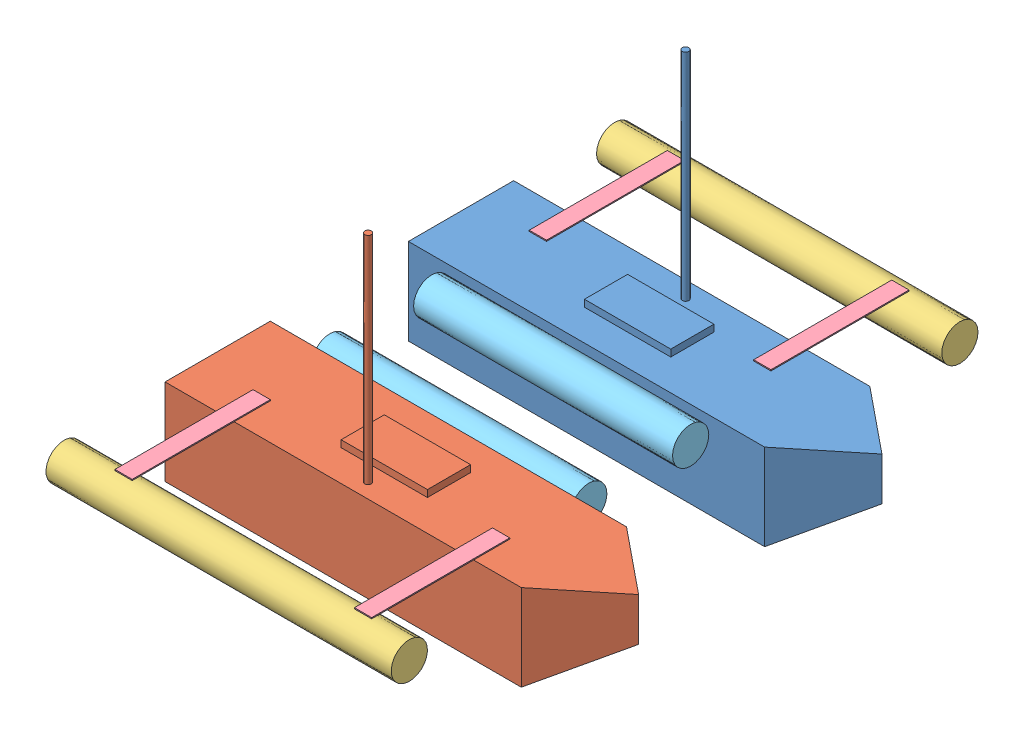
SolidWorks assembly ShoeAssemly.SLDASM, configuration Default (file format 8000). Lengths in mm.
Overall size (1219.2 875 1736.51).
10 component instances, 5 part files, 26 mates.
Components (placement in the parent):
- Shoe-1: Shoe.SLDPRT [Default] at (-239.7629 1156.9486 1236.708) size (1219.2 875 304.8)
- Shoe2-1: Shoe2.SLDPRT [Default] at (-239.7629 1156.9486 1941.508) size (1219.2 875 304.8)
- ShoeBottle-1: ShoeBottle.SLDPRT [Default] at (-239.7629 1354.518 639.408) x (0 -0.511356 0.859369) z (1 0 0) size (105 105 1000)
- ShoeBottle-2: ShoeBottle.SLDPRT [Default] at (760.2371 1354.4486 2234.008) x (0 -0.903336 -0.428934) z (-1 0 0) size (105 105 1000)
- supportsupport-1: supportsupport.SLDPRT [Default] at (-39.7629 1406.9486 1036.708) x (0 0 -1) z (1 0 0) size (400 3.17 50)
- supportsupport-2: supportsupport.SLDPRT [Default] at (610.2371 1406.9486 1036.708) x (0 0 -1) z (1 0 0) size (400 3.17 50)
- supportsupport-3: supportsupport.SLDPRT [Default] at (653.8488 1406.9486 2236.708) x (0 0 -1) z (1 0 0) size (400 3.17 50)
- supportsupport-4: supportsupport.SLDPRT [Default] at (-39.7629 1406.9486 2236.708) x (0 0 -1) z (1 0 0) size (400 3.17 50)
- ShoeBottleInside-1: ShoeBottleInside.SLDPRT [Default] at (630.2371 1356.9486 1289.208) x (0 0 -1) z (-1 0 0) size (105 105 750)
- ShoeBottleInside-2: ShoeBottleInside.SLDPRT [Default] at (-119.7629 1356.9486 1584.208) x (0 0.84554 -0.533912) z (1 0 0) size (105 105 750)
Mates (geometry in assembly coordinates):
- Coincident3: coincident aligned: line of Shoe-1 through (-239.7629 1156.9486 931.908) axis (0 0 1); line of Shoe2-1 through (-239.7629 1156.9486 1636.708) axis (0 0 1)
- Coincident4: coincident anti-aligned: line of Shoe-1 through (791.9371 1156.9486 931.908) axis (0 0 1); line of Shoe2-1 through (791.9371 1156.9486 1941.508) axis (0 0 -1)
- Tangent3: tangent: cylinder of ShoeBottle-1 through (760.2371 1354.518 639.408) axis (-1 0 0) radius 52.5; line of supportsupport-1 through (-39.7629 1406.9486 636.708) axis (-1 0 0)
- Distance10: distance anti-aligned: plane of supportsupport-1 through (-39.7629 1406.9486 1036.708) normal (0 -1 0); plane of Shoe-1 through (-239.7629 1406.9486 1236.708) normal (0 1 0)
- Distance11: distance = 150 mm: line of supportsupport-1 through (-89.7629 1406.9486 636.708) axis (0 0 1); line of Shoe-1 through (-239.7629 1406.9486 931.908) axis (0 0 1)
- Distance12: distance = 200 mm: line of supportsupport-1 through (-89.7629 1406.9486 1036.708) axis (1 0 0); line of Shoe-1 through (-239.7629 1406.9486 1236.708) axis (1 0 0)
- Coincident17: coincident aligned: plane of Shoe-1 through (-239.7629 1406.9486 1236.708) normal (-1 0 0); plane of ShoeBottle-1 through (-239.7629 1354.518 639.408) normal (-1 0 0)
- Distance13: distance = 240 mm anti-aligned: cylinder of ShoeBottle-1 through (760.2371 1354.518 639.408) axis (-1 0 0) radius 52.5; plane of Shoe-1 through (-239.7629 1406.9486 931.908) normal (0 0 -1)
- Coincident19: coincident anti-aligned: plane of Shoe-1 through (-239.7629 1406.9486 1236.708) normal (0 1 0); plane of supportsupport-2 through (610.2371 1406.9486 1036.708) normal (0 -1 0)
- Tangent5: tangent: cylinder of ShoeBottle-1 through (760.2371 1354.518 639.408) axis (-1 0 0) radius 52.5; line of supportsupport-2 through (610.2371 1406.9486 636.708) axis (-1 0 0)
- Distance16: distance = 800 mm: line of supportsupport-2 through (560.2371 1406.9486 636.708) axis (0 0 1); line of Shoe-1 through (-239.7629 1406.9486 931.908) axis (0 0 1)
- Coincident24: coincident aligned: plane of Shoe2-1 through (-239.7629 1406.9486 1941.508) normal (-1 0 0); plane of ShoeBottle-2 through (-239.7629 1354.4486 2234.008) normal (-1 0 0)
- Distance20: distance = 200 mm: line of Shoe2-1 through (791.9371 1406.9486 1636.708) axis (-1 0 0); line of supportsupport-3 through (653.8488 1406.9486 1836.708) axis (-1 0 0)
- Coincident30: coincident anti-aligned: plane of Shoe2-1 through (-239.7629 1406.9486 1941.508) normal (0 1 0); plane of supportsupport-3 through (653.8488 1406.9486 2236.708) normal (0 -1 0)
- Distance21: distance = 400 mm: line of Shoe-1 through (-239.7629 1406.9486 1236.708) axis (1 0 0); line of Shoe2-1 through (791.9371 1406.9486 1636.708) axis (-1 0 0)
- Tangent8: tangent anti-aligned: cylinder of ShoeBottle-2 through (-239.7629 1354.4486 2234.008) axis (1 0 0) radius 52.5; plane of supportsupport-3 through (653.8488 1406.9486 2236.708) normal (0 -1 0)
- Distance22: distance = 240 mm anti-aligned: cylinder of ShoeBottle-2 through (-239.7629 1354.4486 2234.008) axis (1 0 0) radius 52.5; plane of Shoe2-1 through (-239.7629 1406.9486 1941.508) normal (0 0 1)
- Distance23: distance = 200 mm: line of supportsupport-4 through (-39.7629 1406.9486 1836.708) axis (-1 0 0); line of Shoe2-1 through (791.9371 1406.9486 1636.708) axis (-1 0 0)
- Coincident35: coincident anti-aligned: plane of Shoe2-1 through (-239.7629 1406.9486 1941.508) normal (0 1 0); plane of supportsupport-4 through (-39.7629 1406.9486 2236.708) normal (0 -1 0)
- Distance24: distance = 150 mm: line of supportsupport-4 through (-89.7629 1406.9486 1836.708) axis (0 0 1); line of Shoe2-1 through (-239.7629 1406.9486 1636.708) axis (0 0 1)
- Tangent9: tangent anti-aligned: plane of Shoe-1 through (-239.7629 1406.9486 1236.708) normal (0 0 1); cylinder of ShoeBottleInside-1 through (-119.7629 1356.9486 1289.208) axis (1 0 0) radius 52.5
- Distance25: distance = 20 mm: cylinder of ShoeBottleInside-1 through (-119.7629 1356.9486 1289.208) axis (1 0 0) radius 52.5; line of Shoe-1 through (-239.7629 1406.9486 1236.708) axis (1 0 0)
- Tangent10: tangent anti-aligned: plane of Shoe2-1 through (-239.7629 1406.9486 1636.708) normal (0 0 -1); cylinder of ShoeBottleInside-2 through (630.2371 1356.9486 1584.208) axis (-1 0 0) radius 52.5
- Distance26: distance = 20 mm: cylinder of ShoeBottleInside-2 through (630.2371 1356.9486 1584.208) axis (-1 0 0) radius 52.5; line of Shoe2-1 through (791.9371 1406.9486 1636.708) axis (-1 0 0)
- Distance27: distance = 120 mm aligned: plane of ShoeBottleInside-1 through (-119.7629 1356.9486 1289.208) normal (-1 0 0); plane of Shoe-1 through (-239.7629 1406.9486 1236.708) normal (-1 0 0)
- Distance28: distance = 120 mm aligned: plane of ShoeBottleInside-2 through (-119.7629 1356.9486 1584.208) normal (-1 0 0); plane of Shoe2-1 through (-239.7629 1406.9486 1941.508) normal (-1 0 0)
